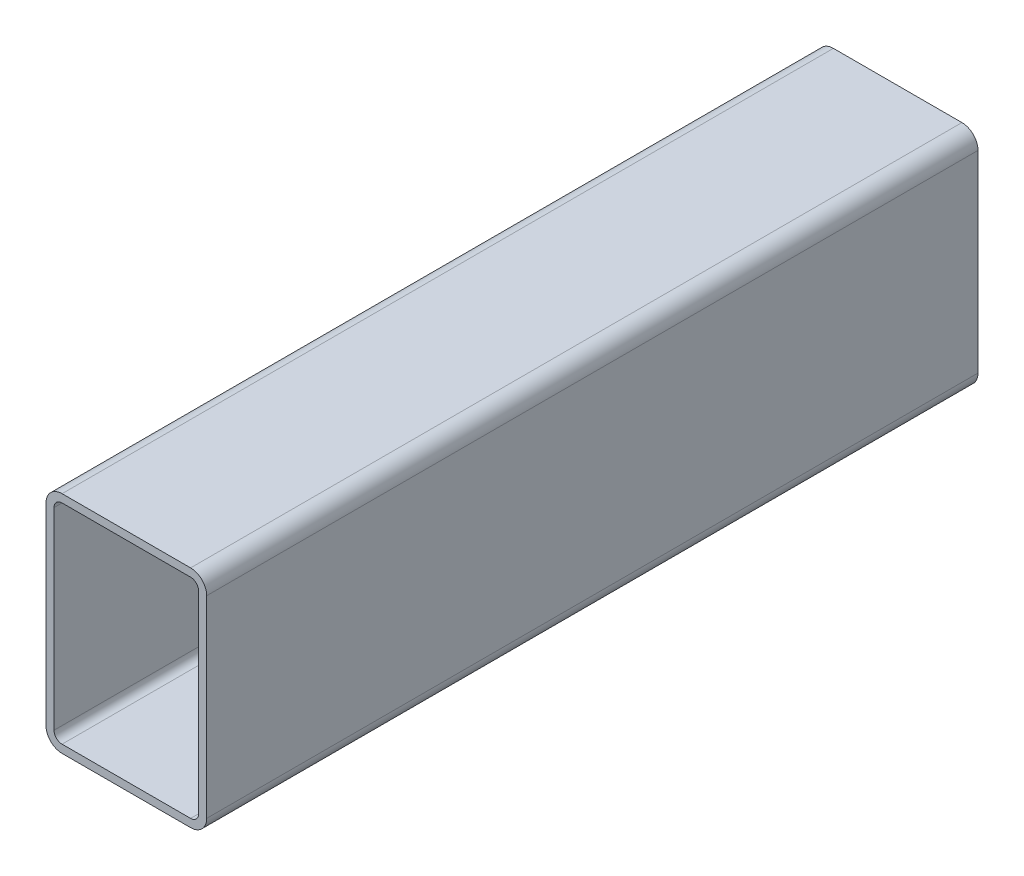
ISO-10303-21;
HEADER;
FILE_DESCRIPTION(('STEP AP214'),'2;1');
FILE_NAME('part.step','',(''),(''),'','','');
FILE_SCHEMA(('AUTOMOTIVE_DESIGN { 1 0 10303 214 1 1 1 1 }'));
ENDSEC;
DATA;
#1=APPLICATION_CONTEXT('core data for automotive mechanical design processes');
#2=APPLICATION_PROTOCOL_DEFINITION('international standard','automotive_design',2000,#1);
#3=PRODUCT_CONTEXT('',#1,'mechanical');
#4=PRODUCT('Part','Part','',(#3));
#5=PRODUCT_RELATED_PRODUCT_CATEGORY('part','',(#4));
#6=PRODUCT_DEFINITION_FORMATION('','',#4);
#7=PRODUCT_DEFINITION_CONTEXT('part definition',#1,'design');
#8=PRODUCT_DEFINITION('design','',#6,#7);
#9=PRODUCT_DEFINITION_SHAPE('','',#8);
#10=(LENGTH_UNIT() NAMED_UNIT(*) SI_UNIT(.MILLI.,.METRE.));
#11=(NAMED_UNIT(*) PLANE_ANGLE_UNIT() SI_UNIT($,.RADIAN.));
#12=(NAMED_UNIT(*) SI_UNIT($,.STERADIAN.) SOLID_ANGLE_UNIT());
#13=UNCERTAINTY_MEASURE_WITH_UNIT(LENGTH_MEASURE(1.E-05),#10,'distance_accuracy_value','');
#14=(GEOMETRIC_REPRESENTATION_CONTEXT(3) GLOBAL_UNCERTAINTY_ASSIGNED_CONTEXT((#13)) GLOBAL_UNIT_ASSIGNED_CONTEXT((#10,
#11,#12)) REPRESENTATION_CONTEXT('',''));
#15=CARTESIAN_POINT('',(0.,0.,0.));
#16=DIRECTION('',(0.,0.,1.));
#17=DIRECTION('',(1.,0.,0.));
#18=AXIS2_PLACEMENT_3D('',#15,#16,#17);
#19=CARTESIAN_POINT('',(9.24608514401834,83.3515103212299,304.8));
#20=DIRECTION('',(0.,0.,1.));
#21=DIRECTION('',(1.,0.,0.));
#22=AXIS2_PLACEMENT_3D('',#19,#20,#21);
#23=PLANE('',#22);
#24=CARTESIAN_POINT('',(9.24608514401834,83.3515103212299,304.8));
#25=DIRECTION('',(0.,0.,1.));
#26=DIRECTION('',(1.,0.,0.));
#27=AXIS2_PLACEMENT_3D('',#24,#25,#26);
#28=CIRCLE('',#27,6.35);
#29=CARTESIAN_POINT('',(9.24608514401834,89.7015103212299,304.8));
#30=VERTEX_POINT('',#29);
#31=CARTESIAN_POINT('',(2.89608514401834,83.3515103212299,304.8));
#32=VERTEX_POINT('',#31);
#33=EDGE_CURVE('E211',#30,#32,#28,.T.);
#34=ORIENTED_EDGE('',*,*,#33,.T.);
#35=DIRECTION('',(0.,-1.,0.));
#36=VECTOR('',#35,1.);
#37=CARTESIAN_POINT('',(2.89608514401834,7.15151032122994,304.8));
#38=LINE('',#37,#36);
#39=CARTESIAN_POINT('',(2.89608514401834,7.15151032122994,304.8));
#40=VERTEX_POINT('',#39);
#41=EDGE_CURVE('E214',#32,#40,#38,.T.);
#42=ORIENTED_EDGE('',*,*,#41,.T.);
#43=CARTESIAN_POINT('',(9.24608514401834,7.15151032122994,304.8));
#44=DIRECTION('',(0.,0.,1.));
#45=DIRECTION('',(1.,0.,0.));
#46=AXIS2_PLACEMENT_3D('',#43,#44,#45);
#47=CIRCLE('',#46,6.35);
#48=CARTESIAN_POINT('',(9.24608514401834,0.801510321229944,304.8));
#49=VERTEX_POINT('',#48);
#50=EDGE_CURVE('E217',#40,#49,#47,.T.);
#51=ORIENTED_EDGE('',*,*,#50,.T.);
#52=DIRECTION('',(1.,0.,0.));
#53=VECTOR('',#52,1.);
#54=CARTESIAN_POINT('',(60.0460851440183,0.801510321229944,304.8));
#55=LINE('',#54,#53);
#56=CARTESIAN_POINT('',(60.0460851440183,0.801510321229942,304.8));
#57=VERTEX_POINT('',#56);
#58=EDGE_CURVE('E219',#49,#57,#55,.T.);
#59=ORIENTED_EDGE('',*,*,#58,.T.);
#60=CARTESIAN_POINT('',(60.0460851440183,7.15151032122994,304.8));
#61=DIRECTION('',(0.,0.,1.));
#62=DIRECTION('',(1.,0.,0.));
#63=AXIS2_PLACEMENT_3D('',#60,#61,#62);
#64=CIRCLE('',#63,6.35);
#65=CARTESIAN_POINT('',(66.3960851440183,7.15151032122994,304.8));
#66=VERTEX_POINT('',#65);
#67=EDGE_CURVE('E221',#57,#66,#64,.T.);
#68=ORIENTED_EDGE('',*,*,#67,.T.);
#69=DIRECTION('',(0.,1.,0.));
#70=VECTOR('',#69,1.);
#71=CARTESIAN_POINT('',(66.3960851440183,83.3515103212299,304.8));
#72=LINE('',#71,#70);
#73=CARTESIAN_POINT('',(66.3960851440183,83.3515103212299,304.8));
#74=VERTEX_POINT('',#73);
#75=EDGE_CURVE('E223',#66,#74,#72,.T.);
#76=ORIENTED_EDGE('',*,*,#75,.T.);
#77=CARTESIAN_POINT('',(60.0460851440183,83.3515103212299,304.8));
#78=DIRECTION('',(0.,0.,1.));
#79=DIRECTION('',(1.,0.,0.));
#80=AXIS2_PLACEMENT_3D('',#77,#78,#79);
#81=CIRCLE('',#80,6.35);
#82=CARTESIAN_POINT('',(60.0460851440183,89.7015103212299,304.8));
#83=VERTEX_POINT('',#82);
#84=EDGE_CURVE('E225',#74,#83,#81,.T.);
#85=ORIENTED_EDGE('',*,*,#84,.T.);
#86=DIRECTION('',(-1.,0.,0.));
#87=VECTOR('',#86,1.);
#88=CARTESIAN_POINT('',(9.24608514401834,89.7015103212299,304.8));
#89=LINE('',#88,#87);
#90=EDGE_CURVE('E227',#83,#30,#89,.T.);
#91=ORIENTED_EDGE('',*,*,#90,.T.);
#92=EDGE_LOOP('',(#34,#42,#51,#59,#68,#76,#85,#91));
#93=FACE_BOUND('',#92,.T.);
#94=DIRECTION('',(0.,-1.,0.));
#95=VECTOR('',#94,1.);
#96=CARTESIAN_POINT('',(6.07108514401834,7.15151032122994,304.8));
#97=LINE('',#96,#95);
#98=CARTESIAN_POINT('',(6.07108514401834,83.3515103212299,304.8));
#99=VERTEX_POINT('',#98);
#100=CARTESIAN_POINT('',(6.07108514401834,7.15151032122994,304.8));
#101=VERTEX_POINT('',#100);
#102=EDGE_CURVE('E154',#99,#101,#97,.T.);
#103=ORIENTED_EDGE('',*,*,#102,.F.);
#104=CARTESIAN_POINT('',(9.24608514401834,83.3515103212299,304.8));
#105=DIRECTION('',(0.,0.,1.));
#106=DIRECTION('',(1.,0.,0.));
#107=AXIS2_PLACEMENT_3D('',#104,#105,#106);
#108=CIRCLE('',#107,3.175);
#109=CARTESIAN_POINT('',(9.24608514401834,86.5265103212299,304.8));
#110=VERTEX_POINT('',#109);
#111=EDGE_CURVE('E146',#110,#99,#108,.T.);
#112=ORIENTED_EDGE('',*,*,#111,.F.);
#113=DIRECTION('',(-1.,0.,0.));
#114=VECTOR('',#113,1.);
#115=CARTESIAN_POINT('',(9.24608514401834,86.5265103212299,304.8));
#116=LINE('',#115,#114);
#117=CARTESIAN_POINT('',(60.0460851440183,86.5265103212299,304.8));
#118=VERTEX_POINT('',#117);
#119=EDGE_CURVE('E179',#118,#110,#116,.T.);
#120=ORIENTED_EDGE('',*,*,#119,.F.);
#121=CARTESIAN_POINT('',(60.0460851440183,83.3515103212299,304.8));
#122=DIRECTION('',(0.,0.,1.));
#123=DIRECTION('',(1.,0.,0.));
#124=AXIS2_PLACEMENT_3D('',#121,#122,#123);
#125=CIRCLE('',#124,3.17500000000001);
#126=CARTESIAN_POINT('',(63.2210851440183,83.3515103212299,304.8));
#127=VERTEX_POINT('',#126);
#128=EDGE_CURVE('E177',#127,#118,#125,.T.);
#129=ORIENTED_EDGE('',*,*,#128,.F.);
#130=DIRECTION('',(0.,1.,0.));
#131=VECTOR('',#130,1.);
#132=CARTESIAN_POINT('',(63.2210851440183,83.3515103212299,304.8));
#133=LINE('',#132,#131);
#134=CARTESIAN_POINT('',(63.2210851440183,7.15151032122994,304.8));
#135=VERTEX_POINT('',#134);
#136=EDGE_CURVE('E175',#135,#127,#133,.T.);
#137=ORIENTED_EDGE('',*,*,#136,.F.);
#138=CARTESIAN_POINT('',(60.0460851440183,7.15151032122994,304.8));
#139=DIRECTION('',(0.,0.,1.));
#140=DIRECTION('',(1.,0.,0.));
#141=AXIS2_PLACEMENT_3D('',#138,#139,#140);
#142=CIRCLE('',#141,3.175);
#143=CARTESIAN_POINT('',(60.0460851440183,3.97651032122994,304.8));
#144=VERTEX_POINT('',#143);
#145=EDGE_CURVE('E173',#144,#135,#142,.T.);
#146=ORIENTED_EDGE('',*,*,#145,.F.);
#147=DIRECTION('',(1.,0.,0.));
#148=VECTOR('',#147,1.);
#149=CARTESIAN_POINT('',(60.0460851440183,3.97651032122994,304.8));
#150=LINE('',#149,#148);
#151=CARTESIAN_POINT('',(9.24608514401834,3.97651032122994,304.8));
#152=VERTEX_POINT('',#151);
#153=EDGE_CURVE('E169',#152,#144,#150,.T.);
#154=ORIENTED_EDGE('',*,*,#153,.F.);
#155=CARTESIAN_POINT('',(9.24608514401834,7.15151032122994,304.8));
#156=DIRECTION('',(0.,0.,1.));
#157=DIRECTION('',(1.,0.,0.));
#158=AXIS2_PLACEMENT_3D('',#155,#156,#157);
#159=CIRCLE('',#158,3.175);
#160=EDGE_CURVE('E167',#101,#152,#159,.T.);
#161=ORIENTED_EDGE('',*,*,#160,.F.);
#162=EDGE_LOOP('',(#103,#112,#120,#129,#137,#146,#154,#161));
#163=FACE_BOUND('',#162,.T.);
#164=ADVANCED_FACE('F33',(#93,#163),#23,.T.);
#165=CARTESIAN_POINT('',(9.24608514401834,83.3515103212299,0.));
#166=DIRECTION('',(0.,0.,1.));
#167=DIRECTION('',(1.,0.,0.));
#168=AXIS2_PLACEMENT_3D('',#165,#166,#167);
#169=PLANE('',#168);
#170=CARTESIAN_POINT('',(9.24608514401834,83.3515103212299,0.));
#171=DIRECTION('',(0.,0.,1.));
#172=DIRECTION('',(1.,0.,0.));
#173=AXIS2_PLACEMENT_3D('',#170,#171,#172);
#174=CIRCLE('',#173,6.35);
#175=CARTESIAN_POINT('',(9.24608514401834,89.7015103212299,0.));
#176=VERTEX_POINT('',#175);
#177=CARTESIAN_POINT('',(2.89608514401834,83.3515103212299,0.));
#178=VERTEX_POINT('',#177);
#179=EDGE_CURVE('E162',#176,#178,#174,.T.);
#180=ORIENTED_EDGE('',*,*,#179,.F.);
#181=DIRECTION('',(-1.,0.,0.));
#182=VECTOR('',#181,1.);
#183=CARTESIAN_POINT('',(9.24608514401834,89.7015103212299,0.));
#184=LINE('',#183,#182);
#185=CARTESIAN_POINT('',(60.0460851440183,89.7015103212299,0.));
#186=VERTEX_POINT('',#185);
#187=EDGE_CURVE('E215',#186,#176,#184,.T.);
#188=ORIENTED_EDGE('',*,*,#187,.F.);
#189=CARTESIAN_POINT('',(60.0460851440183,83.3515103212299,0.));
#190=DIRECTION('',(0.,0.,1.));
#191=DIRECTION('',(1.,0.,0.));
#192=AXIS2_PLACEMENT_3D('',#189,#190,#191);
#193=CIRCLE('',#192,6.35);
#194=CARTESIAN_POINT('',(66.3960851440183,83.3515103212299,0.));
#195=VERTEX_POINT('',#194);
#196=EDGE_CURVE('E242',#195,#186,#193,.T.);
#197=ORIENTED_EDGE('',*,*,#196,.F.);
#198=DIRECTION('',(0.,1.,0.));
#199=VECTOR('',#198,1.);
#200=CARTESIAN_POINT('',(66.3960851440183,83.3515103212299,0.));
#201=LINE('',#200,#199);
#202=CARTESIAN_POINT('',(66.3960851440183,7.15151032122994,0.));
#203=VERTEX_POINT('',#202);
#204=EDGE_CURVE('E240',#203,#195,#201,.T.);
#205=ORIENTED_EDGE('',*,*,#204,.F.);
#206=CARTESIAN_POINT('',(60.0460851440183,7.15151032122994,0.));
#207=DIRECTION('',(0.,0.,1.));
#208=DIRECTION('',(1.,0.,0.));
#209=AXIS2_PLACEMENT_3D('',#206,#207,#208);
#210=CIRCLE('',#209,6.35);
#211=CARTESIAN_POINT('',(60.0460851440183,0.801510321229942,0.));
#212=VERTEX_POINT('',#211);
#213=EDGE_CURVE('E238',#212,#203,#210,.T.);
#214=ORIENTED_EDGE('',*,*,#213,.F.);
#215=DIRECTION('',(1.,0.,0.));
#216=VECTOR('',#215,1.);
#217=CARTESIAN_POINT('',(60.0460851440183,0.801510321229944,0.));
#218=LINE('',#217,#216);
#219=CARTESIAN_POINT('',(9.24608514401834,0.801510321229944,0.));
#220=VERTEX_POINT('',#219);
#221=EDGE_CURVE('E236',#220,#212,#218,.T.);
#222=ORIENTED_EDGE('',*,*,#221,.F.);
#223=CARTESIAN_POINT('',(9.24608514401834,7.15151032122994,0.));
#224=DIRECTION('',(0.,0.,1.));
#225=DIRECTION('',(1.,0.,0.));
#226=AXIS2_PLACEMENT_3D('',#223,#224,#225);
#227=CIRCLE('',#226,6.35);
#228=CARTESIAN_POINT('',(2.89608514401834,7.15151032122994,0.));
#229=VERTEX_POINT('',#228);
#230=EDGE_CURVE('E234',#229,#220,#227,.T.);
#231=ORIENTED_EDGE('',*,*,#230,.F.);
#232=DIRECTION('',(0.,-1.,0.));
#233=VECTOR('',#232,1.);
#234=CARTESIAN_POINT('',(2.89608514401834,7.15151032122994,0.));
#235=LINE('',#234,#233);
#236=EDGE_CURVE('E232',#178,#229,#235,.T.);
#237=ORIENTED_EDGE('',*,*,#236,.F.);
#238=EDGE_LOOP('',(#180,#188,#197,#205,#214,#222,#231,#237));
#239=FACE_BOUND('',#238,.T.);
#240=CARTESIAN_POINT('',(9.24608514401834,83.3515103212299,0.));
#241=DIRECTION('',(0.,0.,1.));
#242=DIRECTION('',(1.,0.,0.));
#243=AXIS2_PLACEMENT_3D('',#240,#241,#242);
#244=CIRCLE('',#243,3.175);
#245=CARTESIAN_POINT('',(9.24608514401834,86.5265103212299,0.));
#246=VERTEX_POINT('',#245);
#247=CARTESIAN_POINT('',(6.07108514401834,83.3515103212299,0.));
#248=VERTEX_POINT('',#247);
#249=EDGE_CURVE('E56',#246,#248,#244,.T.);
#250=ORIENTED_EDGE('',*,*,#249,.T.);
#251=DIRECTION('',(0.,-1.,0.));
#252=VECTOR('',#251,1.);
#253=CARTESIAN_POINT('',(6.07108514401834,7.15151032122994,0.));
#254=LINE('',#253,#252);
#255=CARTESIAN_POINT('',(6.07108514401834,7.15151032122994,0.));
#256=VERTEX_POINT('',#255);
#257=EDGE_CURVE('E161',#248,#256,#254,.T.);
#258=ORIENTED_EDGE('',*,*,#257,.T.);
#259=CARTESIAN_POINT('',(9.24608514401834,7.15151032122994,0.));
#260=DIRECTION('',(0.,0.,1.));
#261=DIRECTION('',(1.,0.,0.));
#262=AXIS2_PLACEMENT_3D('',#259,#260,#261);
#263=CIRCLE('',#262,3.175);
#264=CARTESIAN_POINT('',(9.24608514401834,3.97651032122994,0.));
#265=VERTEX_POINT('',#264);
#266=EDGE_CURVE('E183',#256,#265,#263,.T.);
#267=ORIENTED_EDGE('',*,*,#266,.T.);
#268=DIRECTION('',(1.,0.,0.));
#269=VECTOR('',#268,1.);
#270=CARTESIAN_POINT('',(60.0460851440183,3.97651032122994,0.));
#271=LINE('',#270,#269);
#272=CARTESIAN_POINT('',(60.0460851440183,3.97651032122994,0.));
#273=VERTEX_POINT('',#272);
#274=EDGE_CURVE('E186',#265,#273,#271,.T.);
#275=ORIENTED_EDGE('',*,*,#274,.T.);
#276=CARTESIAN_POINT('',(60.0460851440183,7.15151032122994,0.));
#277=DIRECTION('',(0.,0.,1.));
#278=DIRECTION('',(1.,0.,0.));
#279=AXIS2_PLACEMENT_3D('',#276,#277,#278);
#280=CIRCLE('',#279,3.175);
#281=CARTESIAN_POINT('',(63.2210851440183,7.15151032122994,0.));
#282=VERTEX_POINT('',#281);
#283=EDGE_CURVE('E189',#273,#282,#280,.T.);
#284=ORIENTED_EDGE('',*,*,#283,.T.);
#285=DIRECTION('',(0.,1.,0.));
#286=VECTOR('',#285,1.);
#287=CARTESIAN_POINT('',(63.2210851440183,83.3515103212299,0.));
#288=LINE('',#287,#286);
#289=CARTESIAN_POINT('',(63.2210851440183,83.3515103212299,0.));
#290=VERTEX_POINT('',#289);
#291=EDGE_CURVE('E192',#282,#290,#288,.T.);
#292=ORIENTED_EDGE('',*,*,#291,.T.);
#293=CARTESIAN_POINT('',(60.0460851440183,83.3515103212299,0.));
#294=DIRECTION('',(0.,0.,1.));
#295=DIRECTION('',(1.,0.,0.));
#296=AXIS2_PLACEMENT_3D('',#293,#294,#295);
#297=CIRCLE('',#296,3.17500000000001);
#298=CARTESIAN_POINT('',(60.0460851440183,86.5265103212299,0.));
#299=VERTEX_POINT('',#298);
#300=EDGE_CURVE('E195',#290,#299,#297,.T.);
#301=ORIENTED_EDGE('',*,*,#300,.T.);
#302=DIRECTION('',(-1.,0.,0.));
#303=VECTOR('',#302,1.);
#304=CARTESIAN_POINT('',(9.24608514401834,86.5265103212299,0.));
#305=LINE('',#304,#303);
#306=EDGE_CURVE('E155',#299,#246,#305,.T.);
#307=ORIENTED_EDGE('',*,*,#306,.T.);
#308=EDGE_LOOP('',(#250,#258,#267,#275,#284,#292,#301,#307));
#309=FACE_BOUND('',#308,.T.);
#310=ADVANCED_FACE('F272',(#239,#309),#169,.F.);
#311=CARTESIAN_POINT('',(9.24608514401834,83.3515103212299,304.8));
#312=DIRECTION('',(0.,0.,-1.));
#313=DIRECTION('',(-1.,0.,0.));
#314=AXIS2_PLACEMENT_3D('',#311,#312,#313);
#315=CYLINDRICAL_SURFACE('',#314,6.35);
#316=ORIENTED_EDGE('',*,*,#179,.T.);
#317=DIRECTION('',(0.,0.,-1.));
#318=VECTOR('',#317,1.);
#319=CARTESIAN_POINT('',(2.89608514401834,83.3515103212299,304.8));
#320=LINE('',#319,#318);
#321=EDGE_CURVE('E11',#32,#178,#320,.T.);
#322=ORIENTED_EDGE('',*,*,#321,.F.);
#323=ORIENTED_EDGE('',*,*,#33,.F.);
#324=DIRECTION('',(0.,0.,-1.));
#325=VECTOR('',#324,1.);
#326=CARTESIAN_POINT('',(9.24608514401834,89.7015103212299,304.8));
#327=LINE('',#326,#325);
#328=EDGE_CURVE('E229',#30,#176,#327,.T.);
#329=ORIENTED_EDGE('',*,*,#328,.T.);
#330=EDGE_LOOP('',(#316,#322,#323,#329));
#331=FACE_BOUND('',#330,.T.);
#332=ADVANCED_FACE('F35',(#331),#315,.T.);
#333=CARTESIAN_POINT('',(2.89608514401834,7.15151032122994,304.8));
#334=DIRECTION('',(1.,0.,0.));
#335=DIRECTION('',(0.,0.,-1.));
#336=AXIS2_PLACEMENT_3D('',#333,#334,#335);
#337=PLANE('',#336);
#338=ORIENTED_EDGE('',*,*,#236,.T.);
#339=DIRECTION('',(0.,0.,-1.));
#340=VECTOR('',#339,1.);
#341=CARTESIAN_POINT('',(2.89608514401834,7.15151032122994,304.8));
#342=LINE('',#341,#340);
#343=EDGE_CURVE('E41',#40,#229,#342,.T.);
#344=ORIENTED_EDGE('',*,*,#343,.F.);
#345=ORIENTED_EDGE('',*,*,#41,.F.);
#346=ORIENTED_EDGE('',*,*,#321,.T.);
#347=EDGE_LOOP('',(#338,#344,#345,#346));
#348=FACE_BOUND('',#347,.T.);
#349=ADVANCED_FACE('F289',(#348),#337,.F.);
#350=CARTESIAN_POINT('',(9.24608514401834,7.15151032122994,304.8));
#351=DIRECTION('',(0.,0.,-1.));
#352=DIRECTION('',(-1.,0.,0.));
#353=AXIS2_PLACEMENT_3D('',#350,#351,#352);
#354=CYLINDRICAL_SURFACE('',#353,6.35);
#355=ORIENTED_EDGE('',*,*,#230,.T.);
#356=DIRECTION('',(0.,0.,-1.));
#357=VECTOR('',#356,1.);
#358=CARTESIAN_POINT('',(9.24608514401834,0.801510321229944,304.8));
#359=LINE('',#358,#357);
#360=EDGE_CURVE('E259',#49,#220,#359,.T.);
#361=ORIENTED_EDGE('',*,*,#360,.F.);
#362=ORIENTED_EDGE('',*,*,#50,.F.);
#363=ORIENTED_EDGE('',*,*,#343,.T.);
#364=EDGE_LOOP('',(#355,#361,#362,#363));
#365=FACE_BOUND('',#364,.T.);
#366=ADVANCED_FACE('F266',(#365),#354,.T.);
#367=CARTESIAN_POINT('',(60.0460851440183,0.801510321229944,304.8));
#368=DIRECTION('',(0.,1.,0.));
#369=DIRECTION('',(0.,0.,1.));
#370=AXIS2_PLACEMENT_3D('',#367,#368,#369);
#371=PLANE('',#370);
#372=ORIENTED_EDGE('',*,*,#221,.T.);
#373=DIRECTION('',(0.,0.,-1.));
#374=VECTOR('',#373,1.);
#375=CARTESIAN_POINT('',(60.0460851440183,0.801510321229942,304.8));
#376=LINE('',#375,#374);
#377=EDGE_CURVE('E256',#57,#212,#376,.T.);
#378=ORIENTED_EDGE('',*,*,#377,.F.);
#379=ORIENTED_EDGE('',*,*,#58,.F.);
#380=ORIENTED_EDGE('',*,*,#360,.T.);
#381=EDGE_LOOP('',(#372,#378,#379,#380));
#382=FACE_BOUND('',#381,.T.);
#383=ADVANCED_FACE('F278',(#382),#371,.F.);
#384=CARTESIAN_POINT('',(60.0460851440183,7.15151032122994,304.8));
#385=DIRECTION('',(0.,0.,-1.));
#386=DIRECTION('',(-1.,0.,0.));
#387=AXIS2_PLACEMENT_3D('',#384,#385,#386);
#388=CYLINDRICAL_SURFACE('',#387,6.35);
#389=ORIENTED_EDGE('',*,*,#213,.T.);
#390=DIRECTION('',(0.,0.,-1.));
#391=VECTOR('',#390,1.);
#392=CARTESIAN_POINT('',(66.3960851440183,7.15151032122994,304.8));
#393=LINE('',#392,#391);
#394=EDGE_CURVE('E253',#66,#203,#393,.T.);
#395=ORIENTED_EDGE('',*,*,#394,.F.);
#396=ORIENTED_EDGE('',*,*,#67,.F.);
#397=ORIENTED_EDGE('',*,*,#377,.T.);
#398=EDGE_LOOP('',(#389,#395,#396,#397));
#399=FACE_BOUND('',#398,.T.);
#400=ADVANCED_FACE('F282',(#399),#388,.T.);
#401=CARTESIAN_POINT('',(66.3960851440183,83.3515103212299,304.8));
#402=DIRECTION('',(-1.,0.,0.));
#403=DIRECTION('',(0.,0.,1.));
#404=AXIS2_PLACEMENT_3D('',#401,#402,#403);
#405=PLANE('',#404);
#406=ORIENTED_EDGE('',*,*,#204,.T.);
#407=DIRECTION('',(0.,0.,-1.));
#408=VECTOR('',#407,1.);
#409=CARTESIAN_POINT('',(66.3960851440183,83.3515103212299,304.8));
#410=LINE('',#409,#408);
#411=EDGE_CURVE('E250',#74,#195,#410,.T.);
#412=ORIENTED_EDGE('',*,*,#411,.F.);
#413=ORIENTED_EDGE('',*,*,#75,.F.);
#414=ORIENTED_EDGE('',*,*,#394,.T.);
#415=EDGE_LOOP('',(#406,#412,#413,#414));
#416=FACE_BOUND('',#415,.T.);
#417=ADVANCED_FACE('F302',(#416),#405,.F.);
#418=CARTESIAN_POINT('',(60.0460851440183,83.3515103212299,304.8));
#419=DIRECTION('',(0.,0.,-1.));
#420=DIRECTION('',(-1.,0.,0.));
#421=AXIS2_PLACEMENT_3D('',#418,#419,#420);
#422=CYLINDRICAL_SURFACE('',#421,6.35);
#423=ORIENTED_EDGE('',*,*,#196,.T.);
#424=DIRECTION('',(0.,0.,-1.));
#425=VECTOR('',#424,1.);
#426=CARTESIAN_POINT('',(60.0460851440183,89.7015103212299,304.8));
#427=LINE('',#426,#425);
#428=EDGE_CURVE('E247',#83,#186,#427,.T.);
#429=ORIENTED_EDGE('',*,*,#428,.F.);
#430=ORIENTED_EDGE('',*,*,#84,.F.);
#431=ORIENTED_EDGE('',*,*,#411,.T.);
#432=EDGE_LOOP('',(#423,#429,#430,#431));
#433=FACE_BOUND('',#432,.T.);
#434=ADVANCED_FACE('F300',(#433),#422,.T.);
#435=CARTESIAN_POINT('',(9.24608514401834,89.7015103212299,304.8));
#436=DIRECTION('',(0.,-1.,0.));
#437=DIRECTION('',(0.,0.,-1.));
#438=AXIS2_PLACEMENT_3D('',#435,#436,#437);
#439=PLANE('',#438);
#440=ORIENTED_EDGE('',*,*,#187,.T.);
#441=ORIENTED_EDGE('',*,*,#328,.F.);
#442=ORIENTED_EDGE('',*,*,#90,.F.);
#443=ORIENTED_EDGE('',*,*,#428,.T.);
#444=EDGE_LOOP('',(#440,#441,#442,#443));
#445=FACE_BOUND('',#444,.T.);
#446=ADVANCED_FACE('F295',(#445),#439,.F.);
#447=CARTESIAN_POINT('',(9.24608514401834,83.3515103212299,304.8));
#448=DIRECTION('',(0.,0.,-1.));
#449=DIRECTION('',(-1.,0.,0.));
#450=AXIS2_PLACEMENT_3D('',#447,#448,#449);
#451=CYLINDRICAL_SURFACE('',#450,3.175);
#452=ORIENTED_EDGE('',*,*,#249,.F.);
#453=DIRECTION('',(0.,0.,-1.));
#454=VECTOR('',#453,1.);
#455=CARTESIAN_POINT('',(9.24608514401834,86.5265103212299,304.8));
#456=LINE('',#455,#454);
#457=EDGE_CURVE('E150',#110,#246,#456,.T.);
#458=ORIENTED_EDGE('',*,*,#457,.F.);
#459=ORIENTED_EDGE('',*,*,#111,.T.);
#460=DIRECTION('',(0.,0.,-1.));
#461=VECTOR('',#460,1.);
#462=CARTESIAN_POINT('',(6.07108514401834,83.3515103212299,304.8));
#463=LINE('',#462,#461);
#464=EDGE_CURVE('E149',#99,#248,#463,.T.);
#465=ORIENTED_EDGE('',*,*,#464,.T.);
#466=EDGE_LOOP('',(#452,#458,#459,#465));
#467=FACE_BOUND('',#466,.T.);
#468=ADVANCED_FACE('F148',(#467),#451,.F.);
#469=CARTESIAN_POINT('',(6.07108514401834,7.15151032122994,304.8));
#470=DIRECTION('',(1.,0.,0.));
#471=DIRECTION('',(0.,0.,-1.));
#472=AXIS2_PLACEMENT_3D('',#469,#470,#471);
#473=PLANE('',#472);
#474=ORIENTED_EDGE('',*,*,#257,.F.);
#475=ORIENTED_EDGE('',*,*,#464,.F.);
#476=ORIENTED_EDGE('',*,*,#102,.T.);
#477=DIRECTION('',(0.,0.,-1.));
#478=VECTOR('',#477,1.);
#479=CARTESIAN_POINT('',(6.07108514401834,7.15151032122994,304.8));
#480=LINE('',#479,#478);
#481=EDGE_CURVE('E163',#101,#256,#480,.T.);
#482=ORIENTED_EDGE('',*,*,#481,.T.);
#483=EDGE_LOOP('',(#474,#475,#476,#482));
#484=FACE_BOUND('',#483,.T.);
#485=ADVANCED_FACE('F158',(#484),#473,.T.);
#486=CARTESIAN_POINT('',(9.24608514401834,7.15151032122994,304.8));
#487=DIRECTION('',(0.,0.,-1.));
#488=DIRECTION('',(-1.,0.,0.));
#489=AXIS2_PLACEMENT_3D('',#486,#487,#488);
#490=CYLINDRICAL_SURFACE('',#489,3.175);
#491=ORIENTED_EDGE('',*,*,#266,.F.);
#492=ORIENTED_EDGE('',*,*,#481,.F.);
#493=ORIENTED_EDGE('',*,*,#160,.T.);
#494=DIRECTION('',(0.,0.,-1.));
#495=VECTOR('',#494,1.);
#496=CARTESIAN_POINT('',(9.24608514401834,3.97651032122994,304.8));
#497=LINE('',#496,#495);
#498=EDGE_CURVE('E208',#152,#265,#497,.T.);
#499=ORIENTED_EDGE('',*,*,#498,.T.);
#500=EDGE_LOOP('',(#491,#492,#493,#499));
#501=FACE_BOUND('',#500,.T.);
#502=ADVANCED_FACE('F327',(#501),#490,.F.);
#503=CARTESIAN_POINT('',(60.0460851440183,3.97651032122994,304.8));
#504=DIRECTION('',(0.,1.,0.));
#505=DIRECTION('',(0.,0.,1.));
#506=AXIS2_PLACEMENT_3D('',#503,#504,#505);
#507=PLANE('',#506);
#508=ORIENTED_EDGE('',*,*,#274,.F.);
#509=ORIENTED_EDGE('',*,*,#498,.F.);
#510=ORIENTED_EDGE('',*,*,#153,.T.);
#511=DIRECTION('',(0.,0.,-1.));
#512=VECTOR('',#511,1.);
#513=CARTESIAN_POINT('',(60.0460851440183,3.97651032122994,304.8));
#514=LINE('',#513,#512);
#515=EDGE_CURVE('E206',#144,#273,#514,.T.);
#516=ORIENTED_EDGE('',*,*,#515,.T.);
#517=EDGE_LOOP('',(#508,#509,#510,#516));
#518=FACE_BOUND('',#517,.T.);
#519=ADVANCED_FACE('F331',(#518),#507,.T.);
#520=CARTESIAN_POINT('',(60.0460851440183,7.15151032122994,304.8));
#521=DIRECTION('',(0.,0.,-1.));
#522=DIRECTION('',(-1.,0.,0.));
#523=AXIS2_PLACEMENT_3D('',#520,#521,#522);
#524=CYLINDRICAL_SURFACE('',#523,3.175);
#525=ORIENTED_EDGE('',*,*,#283,.F.);
#526=ORIENTED_EDGE('',*,*,#515,.F.);
#527=ORIENTED_EDGE('',*,*,#145,.T.);
#528=DIRECTION('',(0.,0.,-1.));
#529=VECTOR('',#528,1.);
#530=CARTESIAN_POINT('',(63.2210851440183,7.15151032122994,304.8));
#531=LINE('',#530,#529);
#532=EDGE_CURVE('E204',#135,#282,#531,.T.);
#533=ORIENTED_EDGE('',*,*,#532,.T.);
#534=EDGE_LOOP('',(#525,#526,#527,#533));
#535=FACE_BOUND('',#534,.T.);
#536=ADVANCED_FACE('F337',(#535),#524,.F.);
#537=CARTESIAN_POINT('',(63.2210851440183,83.3515103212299,304.8));
#538=DIRECTION('',(-1.,0.,0.));
#539=DIRECTION('',(0.,0.,1.));
#540=AXIS2_PLACEMENT_3D('',#537,#538,#539);
#541=PLANE('',#540);
#542=ORIENTED_EDGE('',*,*,#291,.F.);
#543=ORIENTED_EDGE('',*,*,#532,.F.);
#544=ORIENTED_EDGE('',*,*,#136,.T.);
#545=DIRECTION('',(0.,0.,-1.));
#546=VECTOR('',#545,1.);
#547=CARTESIAN_POINT('',(63.2210851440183,83.3515103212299,304.8));
#548=LINE('',#547,#546);
#549=EDGE_CURVE('E202',#127,#290,#548,.T.);
#550=ORIENTED_EDGE('',*,*,#549,.T.);
#551=EDGE_LOOP('',(#542,#543,#544,#550));
#552=FACE_BOUND('',#551,.T.);
#553=ADVANCED_FACE('F341',(#552),#541,.T.);
#554=CARTESIAN_POINT('',(60.0460851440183,83.3515103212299,304.8));
#555=DIRECTION('',(0.,0.,-1.));
#556=DIRECTION('',(-1.,0.,0.));
#557=AXIS2_PLACEMENT_3D('',#554,#555,#556);
#558=CYLINDRICAL_SURFACE('',#557,3.17500000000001);
#559=ORIENTED_EDGE('',*,*,#300,.F.);
#560=ORIENTED_EDGE('',*,*,#549,.F.);
#561=ORIENTED_EDGE('',*,*,#128,.T.);
#562=DIRECTION('',(0.,0.,-1.));
#563=VECTOR('',#562,1.);
#564=CARTESIAN_POINT('',(60.0460851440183,86.5265103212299,304.8));
#565=LINE('',#564,#563);
#566=EDGE_CURVE('E48',#118,#299,#565,.T.);
#567=ORIENTED_EDGE('',*,*,#566,.T.);
#568=EDGE_LOOP('',(#559,#560,#561,#567));
#569=FACE_BOUND('',#568,.T.);
#570=ADVANCED_FACE('F345',(#569),#558,.F.);
#571=CARTESIAN_POINT('',(9.24608514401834,86.5265103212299,304.8));
#572=DIRECTION('',(0.,-1.,0.));
#573=DIRECTION('',(0.,0.,-1.));
#574=AXIS2_PLACEMENT_3D('',#571,#572,#573);
#575=PLANE('',#574);
#576=ORIENTED_EDGE('',*,*,#306,.F.);
#577=ORIENTED_EDGE('',*,*,#566,.F.);
#578=ORIENTED_EDGE('',*,*,#119,.T.);
#579=ORIENTED_EDGE('',*,*,#457,.T.);
#580=EDGE_LOOP('',(#576,#577,#578,#579));
#581=FACE_BOUND('',#580,.T.);
#582=ADVANCED_FACE('F349',(#581),#575,.T.);
#583=CLOSED_SHELL('',(#164,#310,#332,#349,#366,#383,#400,#417,#434,#446,#468,#485,#502,#519,
#536,#553,#570,#582));
#584=MANIFOLD_SOLID_BREP('B2',#583);
#585=ADVANCED_BREP_SHAPE_REPRESENTATION('',(#18,#584),#14);
#586=SHAPE_DEFINITION_REPRESENTATION(#9,#585);
ENDSEC;
END-ISO-10303-21;
